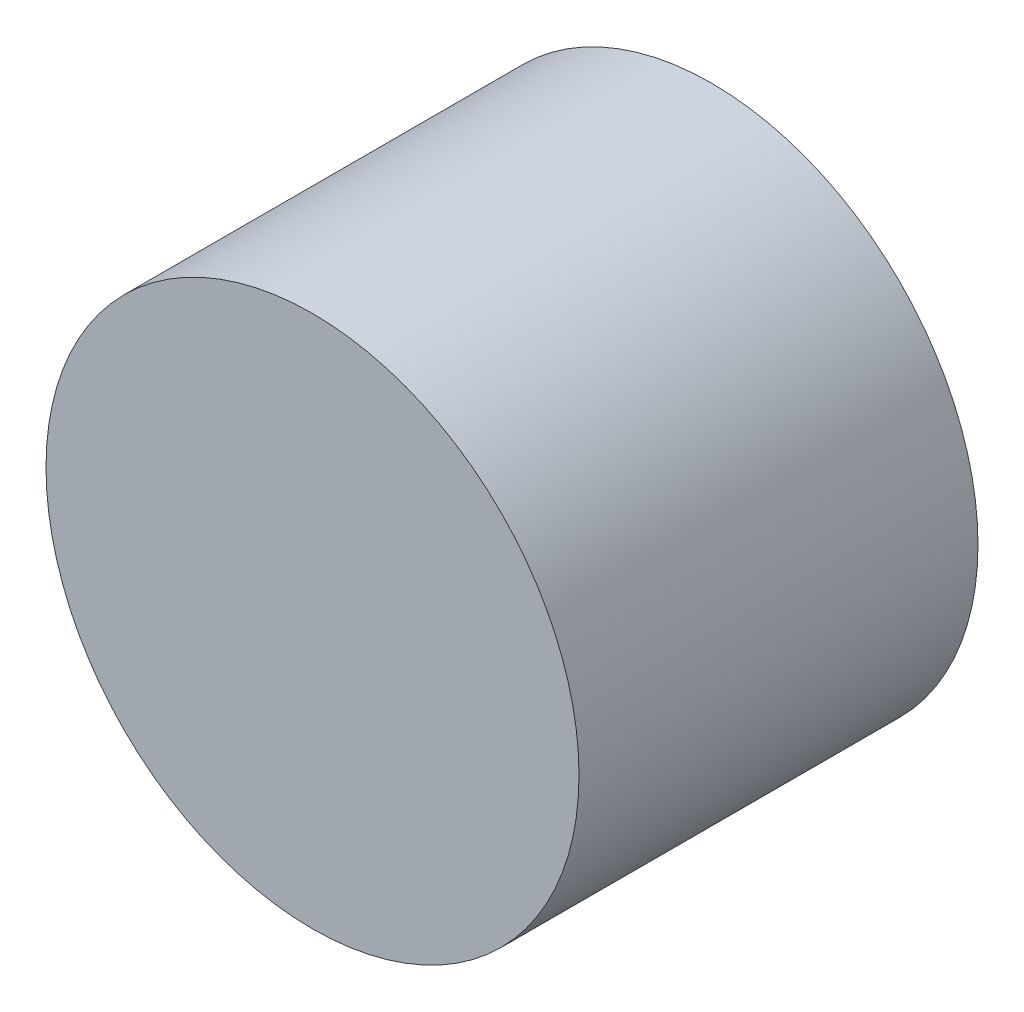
ISO-10303-21;
HEADER;
FILE_DESCRIPTION(('STEP AP214'),'2;1');
FILE_NAME('part.step','',(''),(''),'','','');
FILE_SCHEMA(('AUTOMOTIVE_DESIGN { 1 0 10303 214 1 1 1 1 }'));
ENDSEC;
DATA;
#1=APPLICATION_CONTEXT('core data for automotive mechanical design processes');
#2=APPLICATION_PROTOCOL_DEFINITION('international standard','automotive_design',2000,#1);
#3=PRODUCT_CONTEXT('',#1,'mechanical');
#4=PRODUCT('Part','Part','',(#3));
#5=PRODUCT_RELATED_PRODUCT_CATEGORY('part','',(#4));
#6=PRODUCT_DEFINITION_FORMATION('','',#4);
#7=PRODUCT_DEFINITION_CONTEXT('part definition',#1,'design');
#8=PRODUCT_DEFINITION('design','',#6,#7);
#9=PRODUCT_DEFINITION_SHAPE('','',#8);
#10=(LENGTH_UNIT() NAMED_UNIT(*) SI_UNIT(.MILLI.,.METRE.));
#11=(NAMED_UNIT(*) PLANE_ANGLE_UNIT() SI_UNIT($,.RADIAN.));
#12=(NAMED_UNIT(*) SI_UNIT($,.STERADIAN.) SOLID_ANGLE_UNIT());
#13=UNCERTAINTY_MEASURE_WITH_UNIT(LENGTH_MEASURE(1.E-05),#10,'distance_accuracy_value','');
#14=(GEOMETRIC_REPRESENTATION_CONTEXT(3) GLOBAL_UNCERTAINTY_ASSIGNED_CONTEXT((#13)) GLOBAL_UNIT_ASSIGNED_CONTEXT((#10,
#11,#12)) REPRESENTATION_CONTEXT('',''));
#15=CARTESIAN_POINT('',(0.,0.,0.));
#16=DIRECTION('',(0.,0.,1.));
#17=DIRECTION('',(1.,0.,0.));
#18=AXIS2_PLACEMENT_3D('',#15,#16,#17);
#19=CARTESIAN_POINT('',(0.,0.,52.4));
#20=DIRECTION('',(0.,0.,-1.));
#21=DIRECTION('',(-1.,0.,0.));
#22=AXIS2_PLACEMENT_3D('',#19,#20,#21);
#23=CYLINDRICAL_SURFACE('',#22,35.);
#24=CARTESIAN_POINT('',(0.,0.,52.4));
#25=DIRECTION('',(0.,0.,1.));
#26=DIRECTION('',(1.,0.,0.));
#27=AXIS2_PLACEMENT_3D('',#24,#25,#26);
#28=CIRCLE('',#27,35.);
#29=CARTESIAN_POINT('',(35.,0.,52.4));
#30=VERTEX_POINT('',#29);
#31=EDGE_CURVE('E10',#30,#30,#28,.T.);
#32=ORIENTED_EDGE('',*,*,#31,.F.);
#33=EDGE_LOOP('',(#32));
#34=FACE_BOUND('',#33,.T.);
#35=CARTESIAN_POINT('',(0.,0.,0.));
#36=DIRECTION('',(0.,0.,1.));
#37=DIRECTION('',(1.,0.,0.));
#38=AXIS2_PLACEMENT_3D('',#35,#36,#37);
#39=CIRCLE('',#38,35.);
#40=CARTESIAN_POINT('',(35.,0.,0.));
#41=VERTEX_POINT('',#40);
#42=EDGE_CURVE('E50',#41,#41,#39,.T.);
#43=ORIENTED_EDGE('',*,*,#42,.T.);
#44=EDGE_LOOP('',(#43));
#45=FACE_BOUND('',#44,.T.);
#46=ADVANCED_FACE('F47',(#34,#45),#23,.T.);
#47=CARTESIAN_POINT('',(0.,0.,52.4));
#48=DIRECTION('',(0.,0.,1.));
#49=DIRECTION('',(1.,0.,0.));
#50=AXIS2_PLACEMENT_3D('',#47,#48,#49);
#51=PLANE('',#50);
#52=ORIENTED_EDGE('',*,*,#31,.T.);
#53=EDGE_LOOP('',(#52));
#54=FACE_BOUND('',#53,.T.);
#55=ADVANCED_FACE('F64',(#54),#51,.T.);
#56=CARTESIAN_POINT('',(0.,0.,0.));
#57=DIRECTION('',(0.,0.,1.));
#58=DIRECTION('',(1.,0.,0.));
#59=AXIS2_PLACEMENT_3D('',#56,#57,#58);
#60=PLANE('',#59);
#61=ORIENTED_EDGE('',*,*,#42,.F.);
#62=EDGE_LOOP('',(#61));
#63=FACE_BOUND('',#62,.T.);
#64=ADVANCED_FACE('F62',(#63),#60,.F.);
#65=CLOSED_SHELL('',(#46,#55,#64));
#66=MANIFOLD_SOLID_BREP('B2',#65);
#67=ADVANCED_BREP_SHAPE_REPRESENTATION('',(#18,#66),#14);
#68=SHAPE_DEFINITION_REPRESENTATION(#9,#67);
ENDSEC;
END-ISO-10303-21;
